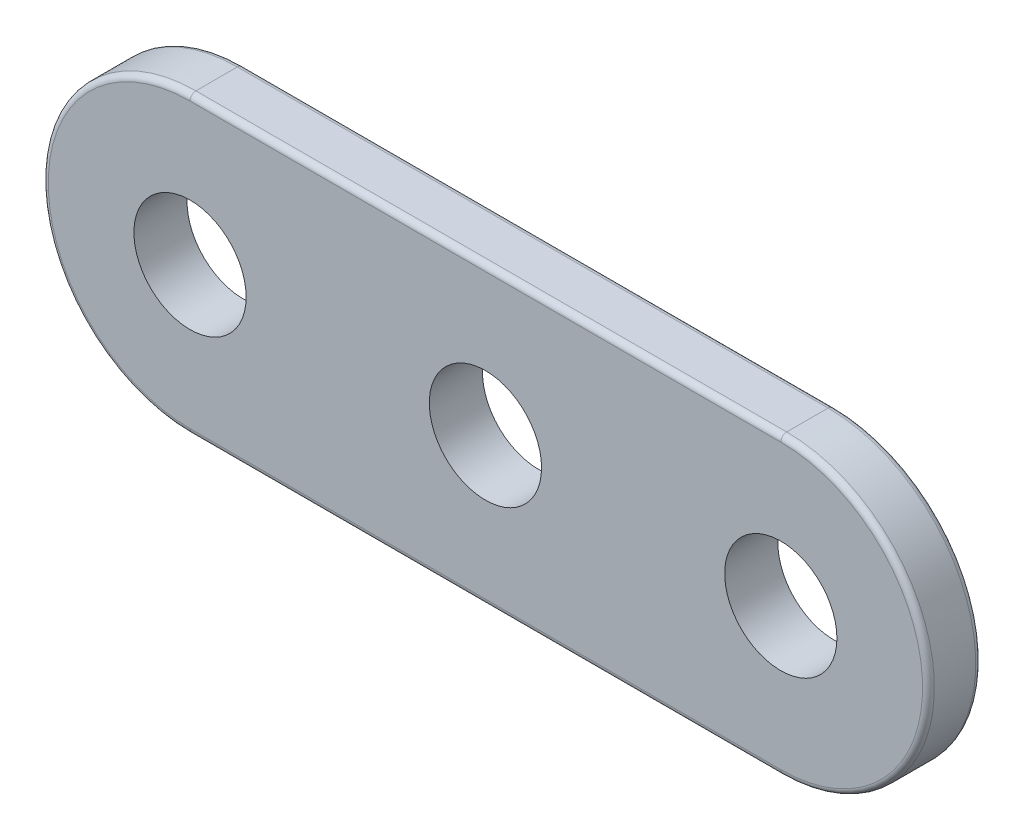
from build123d import *

# Parameters (mm, degrees)
BOSS_EXTRUDE1_DEPTH = 2.286
SKETCH2_R           = 2.413
CUT_EXTRUDE1_DEPTH  = 21.21016566
LPATTERN1_COUNT     = 3
LPATTERN1_PITCH     = 12.7
FILLET1_R           = 0.254


with BuildPart() as part:
    # Sketch1 → Boss-Extrude1 (new body)
    with BuildSketch(Plane.XY):
        with BuildLine():
            Line((-12.7, 6.35), (12.7, 6.35))
            ThreePointArc((12.7, 6.35), (19.05, 0), (12.7, -6.35))
            Line((12.7, -6.35), (-12.7, -6.35))
            ThreePointArc((-12.7, -6.35), (-19.05, 0), (-12.7, 6.35))
        make_face()
    extrude(amount=BOSS_EXTRUDE1_DEPTH)

    # Sketch2 → Cut-Extrude1 (cut, through all)
    with BuildSketch(Plane.XY.offset(2.286)):
        with Locations((-12.7, 0)):
            Circle(SKETCH2_R)
    cut_extrude1 = extrude(amount=-CUT_EXTRUDE1_DEPTH, mode=Mode.SUBTRACT)

    # LPattern1: Cut-Extrude1 ×3
    with Locations(*[(i * LPATTERN1_PITCH, 0, 0) for i in range(1, LPATTERN1_COUNT)]):
        add(cut_extrude1, mode=Mode.SUBTRACT)

    # Fillet1
    fillet1_edges = [part.edges().sort_by_distance(p)[0] for p in [
        (19.05, 0, 2.286),
        (0, 6.35, 2.286),
        (-19.05, 0, 2.286),
        (0, 6.35, 0),
        (19.05, 0, 0),
        (0, -6.35, 0),
        (-19.05, 0, 0),
        (0, -6.35, 2.286),
    ]]
    fillet(fillet1_edges, radius=FILLET1_R)


solid = part.part
